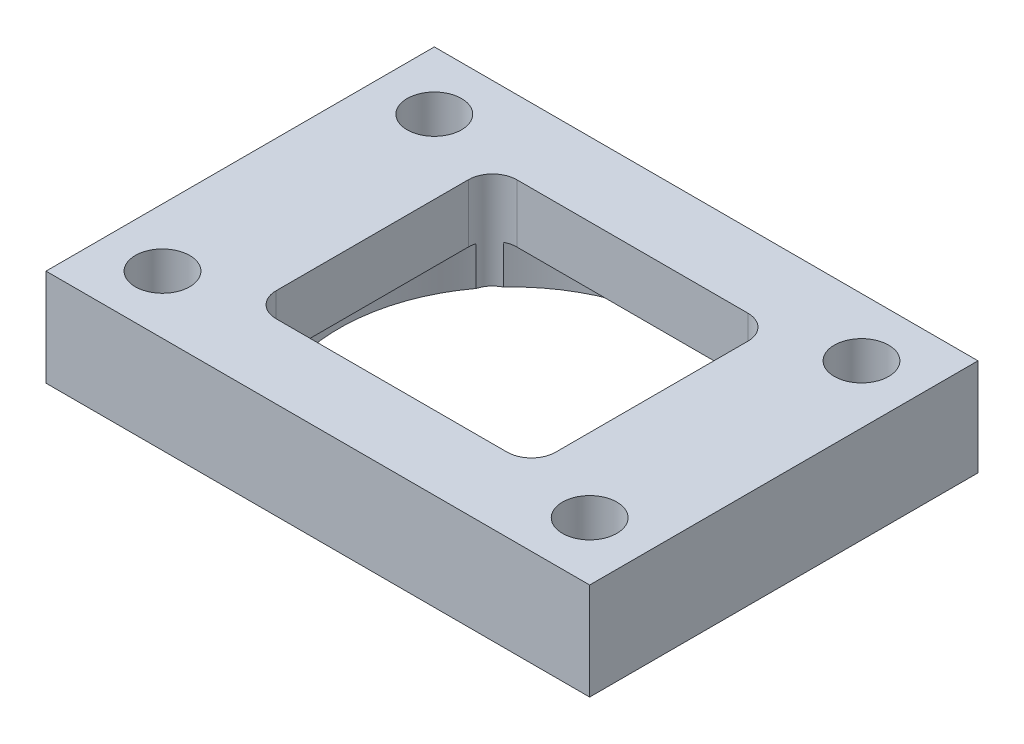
ISO-10303-21;
HEADER;
FILE_DESCRIPTION(('STEP AP214'),'2;1');
FILE_NAME('part.step','',(''),(''),'','','');
FILE_SCHEMA(('AUTOMOTIVE_DESIGN { 1 0 10303 214 1 1 1 1 }'));
ENDSEC;
DATA;
#1=APPLICATION_CONTEXT('core data for automotive mechanical design processes');
#2=APPLICATION_PROTOCOL_DEFINITION('international standard','automotive_design',2000,#1);
#3=PRODUCT_CONTEXT('',#1,'mechanical');
#4=PRODUCT('Part','Part','',(#3));
#5=PRODUCT_RELATED_PRODUCT_CATEGORY('part','',(#4));
#6=PRODUCT_DEFINITION_FORMATION('','',#4);
#7=PRODUCT_DEFINITION_CONTEXT('part definition',#1,'design');
#8=PRODUCT_DEFINITION('design','',#6,#7);
#9=PRODUCT_DEFINITION_SHAPE('','',#8);
#10=(LENGTH_UNIT() NAMED_UNIT(*) SI_UNIT(.MILLI.,.METRE.));
#11=(NAMED_UNIT(*) PLANE_ANGLE_UNIT() SI_UNIT($,.RADIAN.));
#12=(NAMED_UNIT(*) SI_UNIT($,.STERADIAN.) SOLID_ANGLE_UNIT());
#13=UNCERTAINTY_MEASURE_WITH_UNIT(LENGTH_MEASURE(1.E-05),#10,'distance_accuracy_value','');
#14=(GEOMETRIC_REPRESENTATION_CONTEXT(3) GLOBAL_UNCERTAINTY_ASSIGNED_CONTEXT((#13)) GLOBAL_UNIT_ASSIGNED_CONTEXT((#10,
#11,#12)) REPRESENTATION_CONTEXT('',''));
#15=CARTESIAN_POINT('',(0.,0.,0.));
#16=DIRECTION('',(0.,0.,1.));
#17=DIRECTION('',(1.,0.,0.));
#18=AXIS2_PLACEMENT_3D('',#15,#16,#17);
#19=CARTESIAN_POINT('',(0.,2.54,0.));
#20=DIRECTION('',(0.,-1.,0.));
#21=DIRECTION('',(0.,0.,-1.));
#22=AXIS2_PLACEMENT_3D('',#19,#20,#21);
#23=CYLINDRICAL_SURFACE('',#22,11.303);
#24=CARTESIAN_POINT('',(0.,0.,0.));
#25=DIRECTION('',(0.,-1.,0.));
#26=DIRECTION('',(0.,0.,-1.));
#27=AXIS2_PLACEMENT_3D('',#24,#25,#26);
#28=CIRCLE('',#27,11.303);
#29=CARTESIAN_POINT('',(-8.27041971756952,0.,-7.70441215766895));
#30=VERTEX_POINT('',#29);
#31=CARTESIAN_POINT('',(8.27041971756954,0.,-7.70441215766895));
#32=VERTEX_POINT('',#31);
#33=EDGE_CURVE('E310',#30,#32,#28,.T.);
#34=ORIENTED_EDGE('',*,*,#33,.T.);
#35=DIRECTION('',(0.,-1.,0.));
#36=VECTOR('',#35,1.);
#37=CARTESIAN_POINT('',(8.27041971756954,0.,-7.70441215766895));
#38=LINE('',#37,#36);
#39=CARTESIAN_POINT('',(8.27041971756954,2.54,-7.70441215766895));
#40=VERTEX_POINT('',#39);
#41=EDGE_CURVE('E239',#32,#40,#38,.F.);
#42=ORIENTED_EDGE('',*,*,#41,.T.);
#43=CARTESIAN_POINT('',(0.,2.54,0.));
#44=DIRECTION('',(0.,-1.,0.));
#45=DIRECTION('',(0.,0.,-1.));
#46=AXIS2_PLACEMENT_3D('',#43,#44,#45);
#47=CIRCLE('',#46,11.303);
#48=CARTESIAN_POINT('',(-8.27041971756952,2.54,-7.70441215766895));
#49=VERTEX_POINT('',#48);
#50=EDGE_CURVE('E316',#49,#40,#47,.T.);
#51=ORIENTED_EDGE('',*,*,#50,.F.);
#52=DIRECTION('',(0.,-1.,0.));
#53=VECTOR('',#52,1.);
#54=CARTESIAN_POINT('',(-8.27041971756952,2.54,-7.70441215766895));
#55=LINE('',#54,#53);
#56=EDGE_CURVE('E279',#49,#30,#55,.T.);
#57=ORIENTED_EDGE('',*,*,#56,.T.);
#58=EDGE_LOOP('',(#34,#42,#51,#57));
#59=FACE_BOUND('',#58,.T.);
#60=ADVANCED_FACE('F30',(#59),#23,.F.);
#61=CARTESIAN_POINT('',(9.08064390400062,0.,-6.73050631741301));
#62=VERTEX_POINT('',#61);
#63=CARTESIAN_POINT('',(9.08064390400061,0.,6.73050631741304));
#64=VERTEX_POINT('',#63);
#65=EDGE_CURVE('E312',#62,#64,#28,.T.);
#66=ORIENTED_EDGE('',*,*,#65,.T.);
#67=DIRECTION('',(0.,-1.,0.));
#68=VECTOR('',#67,1.);
#69=CARTESIAN_POINT('',(9.08064390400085,0.,6.7305063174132));
#70=LINE('',#69,#68);
#71=CARTESIAN_POINT('',(9.08064390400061,2.54,6.73050631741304));
#72=VERTEX_POINT('',#71);
#73=EDGE_CURVE('E255',#64,#72,#70,.F.);
#74=ORIENTED_EDGE('',*,*,#73,.T.);
#75=CARTESIAN_POINT('',(9.08064390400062,2.54,-6.73050631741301));
#76=VERTEX_POINT('',#75);
#77=EDGE_CURVE('E325',#76,#72,#47,.T.);
#78=ORIENTED_EDGE('',*,*,#77,.F.);
#79=DIRECTION('',(0.,-1.,0.));
#80=VECTOR('',#79,1.);
#81=CARTESIAN_POINT('',(9.08064390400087,2.54,-6.7305063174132));
#82=LINE('',#81,#80);
#83=EDGE_CURVE('E233',#76,#62,#82,.T.);
#84=ORIENTED_EDGE('',*,*,#83,.T.);
#85=EDGE_LOOP('',(#66,#74,#78,#84));
#86=FACE_BOUND('',#85,.T.);
#87=ADVANCED_FACE('F370',(#86),#23,.F.);
#88=CARTESIAN_POINT('',(8.27041971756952,0.,7.70441215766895));
#89=VERTEX_POINT('',#88);
#90=CARTESIAN_POINT('',(-8.27041971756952,0.,7.70441215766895));
#91=VERTEX_POINT('',#90);
#92=EDGE_CURVE('E309',#89,#91,#28,.T.);
#93=ORIENTED_EDGE('',*,*,#92,.T.);
#94=DIRECTION('',(0.,-1.,0.));
#95=VECTOR('',#94,1.);
#96=CARTESIAN_POINT('',(-8.27041971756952,0.,7.70441215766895));
#97=LINE('',#96,#95);
#98=CARTESIAN_POINT('',(-8.27041971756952,2.54,7.70441215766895));
#99=VERTEX_POINT('',#98);
#100=EDGE_CURVE('E269',#91,#99,#97,.F.);
#101=ORIENTED_EDGE('',*,*,#100,.T.);
#102=CARTESIAN_POINT('',(8.27041971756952,2.54,7.70441215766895));
#103=VERTEX_POINT('',#102);
#104=EDGE_CURVE('E400',#103,#99,#47,.T.);
#105=ORIENTED_EDGE('',*,*,#104,.F.);
#106=DIRECTION('',(0.,-1.,0.));
#107=VECTOR('',#106,1.);
#108=CARTESIAN_POINT('',(8.27041971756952,2.54,7.70441215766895));
#109=LINE('',#108,#107);
#110=EDGE_CURVE('E249',#103,#89,#109,.T.);
#111=ORIENTED_EDGE('',*,*,#110,.T.);
#112=EDGE_LOOP('',(#93,#101,#105,#111));
#113=FACE_BOUND('',#112,.T.);
#114=ADVANCED_FACE('F376',(#113),#23,.F.);
#115=CARTESIAN_POINT('',(0.,2.54,0.));
#116=DIRECTION('',(0.,-1.,0.));
#117=DIRECTION('',(0.,0.,-1.));
#118=AXIS2_PLACEMENT_3D('',#115,#116,#117);
#119=PLANE('',#118);
#120=DIRECTION('',(1.,0.,0.));
#121=VECTOR('',#120,1.);
#122=CARTESIAN_POINT('',(0.,2.54,-7.87399999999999));
#123=LINE('',#122,#121);
#124=CARTESIAN_POINT('',(-7.5565,2.54,-7.87399999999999));
#125=VERTEX_POINT('',#124);
#126=CARTESIAN_POINT('',(7.55650000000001,2.54,-7.87399999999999));
#127=VERTEX_POINT('',#126);
#128=EDGE_CURVE('E205',#125,#127,#123,.T.);
#129=ORIENTED_EDGE('',*,*,#128,.F.);
#130=CARTESIAN_POINT('',(-7.5565,2.54,-6.2865));
#131=DIRECTION('',(0.,-1.,0.));
#132=DIRECTION('',(0.,0.,-1.));
#133=AXIS2_PLACEMENT_3D('',#130,#131,#132);
#134=CIRCLE('',#133,1.5875);
#135=EDGE_CURVE('E276',#125,#49,#134,.F.);
#136=ORIENTED_EDGE('',*,*,#135,.T.);
#137=ORIENTED_EDGE('',*,*,#50,.T.);
#138=CARTESIAN_POINT('',(7.5565,2.54,-6.2865));
#139=DIRECTION('',(0.,-1.,0.));
#140=DIRECTION('',(0.,0.,-1.));
#141=AXIS2_PLACEMENT_3D('',#138,#139,#140);
#142=CIRCLE('',#141,1.5875);
#143=EDGE_CURVE('E242',#40,#127,#142,.F.);
#144=ORIENTED_EDGE('',*,*,#143,.T.);
#145=EDGE_LOOP('',(#129,#136,#137,#144));
#146=FACE_BOUND('',#145,.T.);
#147=ADVANCED_FACE('F387',(#146),#119,.T.);
#148=DIRECTION('',(0.,0.,1.));
#149=VECTOR('',#148,1.);
#150=CARTESIAN_POINT('',(9.144,2.54,0.));
#151=LINE('',#150,#149);
#152=CARTESIAN_POINT('',(9.14400000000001,2.54,-6.2865));
#153=VERTEX_POINT('',#152);
#154=CARTESIAN_POINT('',(9.144,2.54,6.2865));
#155=VERTEX_POINT('',#154);
#156=EDGE_CURVE('E202',#153,#155,#151,.T.);
#157=ORIENTED_EDGE('',*,*,#156,.F.);
#158=CARTESIAN_POINT('',(7.5565,2.54,-6.2865));
#159=DIRECTION('',(0.,-1.,0.));
#160=DIRECTION('',(0.,0.,-1.));
#161=AXIS2_PLACEMENT_3D('',#158,#159,#160);
#162=CIRCLE('',#161,1.5875);
#163=EDGE_CURVE('E230',#153,#76,#162,.F.);
#164=ORIENTED_EDGE('',*,*,#163,.T.);
#165=ORIENTED_EDGE('',*,*,#77,.T.);
#166=CARTESIAN_POINT('',(7.55650000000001,2.54,6.2865));
#167=DIRECTION('',(0.,-1.,0.));
#168=DIRECTION('',(0.,0.,-1.));
#169=AXIS2_PLACEMENT_3D('',#166,#167,#168);
#170=CIRCLE('',#169,1.5875);
#171=EDGE_CURVE('E258',#72,#155,#170,.F.);
#172=ORIENTED_EDGE('',*,*,#171,.T.);
#173=EDGE_LOOP('',(#157,#164,#165,#172));
#174=FACE_BOUND('',#173,.T.);
#175=ADVANCED_FACE('F396',(#174),#119,.T.);
#176=DIRECTION('',(-1.,0.,0.));
#177=VECTOR('',#176,1.);
#178=CARTESIAN_POINT('',(0.,2.54,7.87399999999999));
#179=LINE('',#178,#177);
#180=CARTESIAN_POINT('',(7.5565,2.54,7.87399999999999));
#181=VERTEX_POINT('',#180);
#182=CARTESIAN_POINT('',(-7.5565,2.54,7.87399999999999));
#183=VERTEX_POINT('',#182);
#184=EDGE_CURVE('E194',#181,#183,#179,.T.);
#185=ORIENTED_EDGE('',*,*,#184,.F.);
#186=CARTESIAN_POINT('',(7.55650000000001,2.54,6.2865));
#187=DIRECTION('',(0.,-1.,0.));
#188=DIRECTION('',(0.,0.,-1.));
#189=AXIS2_PLACEMENT_3D('',#186,#187,#188);
#190=CIRCLE('',#189,1.5875);
#191=EDGE_CURVE('E246',#181,#103,#190,.F.);
#192=ORIENTED_EDGE('',*,*,#191,.T.);
#193=ORIENTED_EDGE('',*,*,#104,.T.);
#194=CARTESIAN_POINT('',(-7.5565,2.54,6.2865));
#195=DIRECTION('',(0.,-1.,0.));
#196=DIRECTION('',(0.,0.,-1.));
#197=AXIS2_PLACEMENT_3D('',#194,#195,#196);
#198=CIRCLE('',#197,1.5875);
#199=EDGE_CURVE('E272',#99,#183,#198,.F.);
#200=ORIENTED_EDGE('',*,*,#199,.T.);
#201=EDGE_LOOP('',(#185,#192,#193,#200));
#202=FACE_BOUND('',#201,.T.);
#203=ADVANCED_FACE('F388',(#202),#119,.T.);
#204=CARTESIAN_POINT('',(17.78,6.34999999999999,-12.7));
#205=DIRECTION('',(0.,0.,1.));
#206=DIRECTION('',(1.,0.,0.));
#207=AXIS2_PLACEMENT_3D('',#204,#205,#206);
#208=PLANE('',#207);
#209=DIRECTION('',(-1.,0.,0.));
#210=VECTOR('',#209,1.);
#211=CARTESIAN_POINT('',(17.78,0.,-12.7));
#212=LINE('',#211,#210);
#213=CARTESIAN_POINT('',(17.78,0.,-12.7));
#214=VERTEX_POINT('',#213);
#215=CARTESIAN_POINT('',(-17.78,0.,-12.7));
#216=VERTEX_POINT('',#215);
#217=EDGE_CURVE('E190',#214,#216,#212,.T.);
#218=ORIENTED_EDGE('',*,*,#217,.T.);
#219=DIRECTION('',(0.,-1.,0.));
#220=VECTOR('',#219,1.);
#221=CARTESIAN_POINT('',(-17.78,6.34999999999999,-12.7));
#222=LINE('',#221,#220);
#223=CARTESIAN_POINT('',(-17.78,6.34999999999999,-12.7));
#224=VERTEX_POINT('',#223);
#225=EDGE_CURVE('E170',#224,#216,#222,.T.);
#226=ORIENTED_EDGE('',*,*,#225,.F.);
#227=DIRECTION('',(-1.,0.,0.));
#228=VECTOR('',#227,1.);
#229=CARTESIAN_POINT('',(17.78,6.34999999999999,-12.7));
#230=LINE('',#229,#228);
#231=CARTESIAN_POINT('',(17.78,6.34999999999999,-12.7));
#232=VERTEX_POINT('',#231);
#233=EDGE_CURVE('E177',#232,#224,#230,.T.);
#234=ORIENTED_EDGE('',*,*,#233,.F.);
#235=DIRECTION('',(0.,-1.,0.));
#236=VECTOR('',#235,1.);
#237=CARTESIAN_POINT('',(17.78,6.34999999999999,-12.7));
#238=LINE('',#237,#236);
#239=EDGE_CURVE('E345',#232,#214,#238,.T.);
#240=ORIENTED_EDGE('',*,*,#239,.T.);
#241=EDGE_LOOP('',(#218,#226,#234,#240));
#242=FACE_BOUND('',#241,.T.);
#243=ADVANCED_FACE('F188',(#242),#208,.F.);
#244=CARTESIAN_POINT('',(-17.78,6.34999999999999,12.7));
#245=DIRECTION('',(1.,0.,0.));
#246=DIRECTION('',(0.,0.,-1.));
#247=AXIS2_PLACEMENT_3D('',#244,#245,#246);
#248=PLANE('',#247);
#249=DIRECTION('',(0.,0.,1.));
#250=VECTOR('',#249,1.);
#251=CARTESIAN_POINT('',(-17.78,0.,12.7));
#252=LINE('',#251,#250);
#253=CARTESIAN_POINT('',(-17.78,0.,12.7));
#254=VERTEX_POINT('',#253);
#255=EDGE_CURVE('E347',#216,#254,#252,.T.);
#256=ORIENTED_EDGE('',*,*,#255,.T.);
#257=DIRECTION('',(0.,-1.,0.));
#258=VECTOR('',#257,1.);
#259=CARTESIAN_POINT('',(-17.78,6.34999999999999,12.7));
#260=LINE('',#259,#258);
#261=CARTESIAN_POINT('',(-17.78,6.34999999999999,12.7));
#262=VERTEX_POINT('',#261);
#263=EDGE_CURVE('E173',#262,#254,#260,.T.);
#264=ORIENTED_EDGE('',*,*,#263,.F.);
#265=DIRECTION('',(0.,0.,1.));
#266=VECTOR('',#265,1.);
#267=CARTESIAN_POINT('',(-17.78,6.34999999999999,12.7));
#268=LINE('',#267,#266);
#269=EDGE_CURVE('E166',#224,#262,#268,.T.);
#270=ORIENTED_EDGE('',*,*,#269,.F.);
#271=ORIENTED_EDGE('',*,*,#225,.T.);
#272=EDGE_LOOP('',(#256,#264,#270,#271));
#273=FACE_BOUND('',#272,.T.);
#274=ADVANCED_FACE('F168',(#273),#248,.F.);
#275=CARTESIAN_POINT('',(17.78,6.34999999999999,12.7));
#276=DIRECTION('',(0.,0.,-1.));
#277=DIRECTION('',(-1.,0.,0.));
#278=AXIS2_PLACEMENT_3D('',#275,#276,#277);
#279=PLANE('',#278);
#280=DIRECTION('',(1.,0.,0.));
#281=VECTOR('',#280,1.);
#282=CARTESIAN_POINT('',(17.78,0.,12.7));
#283=LINE('',#282,#281);
#284=CARTESIAN_POINT('',(17.78,0.,12.7));
#285=VERTEX_POINT('',#284);
#286=EDGE_CURVE('E349',#254,#285,#283,.T.);
#287=ORIENTED_EDGE('',*,*,#286,.T.);
#288=DIRECTION('',(0.,-1.,0.));
#289=VECTOR('',#288,1.);
#290=CARTESIAN_POINT('',(17.78,6.34999999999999,12.7));
#291=LINE('',#290,#289);
#292=CARTESIAN_POINT('',(17.78,6.34999999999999,12.7));
#293=VERTEX_POINT('',#292);
#294=EDGE_CURVE('E196',#293,#285,#291,.T.);
#295=ORIENTED_EDGE('',*,*,#294,.F.);
#296=DIRECTION('',(1.,0.,0.));
#297=VECTOR('',#296,1.);
#298=CARTESIAN_POINT('',(17.78,6.34999999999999,12.7));
#299=LINE('',#298,#297);
#300=EDGE_CURVE('E176',#262,#293,#299,.T.);
#301=ORIENTED_EDGE('',*,*,#300,.F.);
#302=ORIENTED_EDGE('',*,*,#263,.T.);
#303=EDGE_LOOP('',(#287,#295,#301,#302));
#304=FACE_BOUND('',#303,.T.);
#305=ADVANCED_FACE('F360',(#304),#279,.F.);
#306=CARTESIAN_POINT('',(17.78,6.34999999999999,12.7));
#307=DIRECTION('',(-1.,0.,0.));
#308=DIRECTION('',(0.,0.,1.));
#309=AXIS2_PLACEMENT_3D('',#306,#307,#308);
#310=PLANE('',#309);
#311=DIRECTION('',(0.,0.,-1.));
#312=VECTOR('',#311,1.);
#313=CARTESIAN_POINT('',(17.78,0.,12.7));
#314=LINE('',#313,#312);
#315=EDGE_CURVE('E186',#285,#214,#314,.T.);
#316=ORIENTED_EDGE('',*,*,#315,.T.);
#317=ORIENTED_EDGE('',*,*,#239,.F.);
#318=DIRECTION('',(0.,0.,-1.));
#319=VECTOR('',#318,1.);
#320=CARTESIAN_POINT('',(17.78,6.34999999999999,12.7));
#321=LINE('',#320,#319);
#322=EDGE_CURVE('E182',#293,#232,#321,.T.);
#323=ORIENTED_EDGE('',*,*,#322,.F.);
#324=ORIENTED_EDGE('',*,*,#294,.T.);
#325=EDGE_LOOP('',(#316,#317,#323,#324));
#326=FACE_BOUND('',#325,.T.);
#327=ADVANCED_FACE('F356',(#326),#310,.F.);
#328=CARTESIAN_POINT('',(-17.78,6.34999999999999,-12.7));
#329=DIRECTION('',(0.,-1.,0.));
#330=DIRECTION('',(0.,0.,-1.));
#331=AXIS2_PLACEMENT_3D('',#328,#329,#330);
#332=PLANE('',#331);
#333=DIRECTION('',(0.,0.,1.));
#334=VECTOR('',#333,1.);
#335=CARTESIAN_POINT('',(-9.144,6.34999999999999,7.87399999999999));
#336=LINE('',#335,#334);
#337=CARTESIAN_POINT('',(-9.144,6.34999999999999,-6.2865));
#338=VERTEX_POINT('',#337);
#339=CARTESIAN_POINT('',(-9.144,6.34999999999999,6.2865));
#340=VERTEX_POINT('',#339);
#341=EDGE_CURVE('E298',#338,#340,#336,.T.);
#342=ORIENTED_EDGE('',*,*,#341,.F.);
#343=CARTESIAN_POINT('',(-7.5565,6.34999999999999,-6.2865));
#344=DIRECTION('',(0.,-1.,0.));
#345=DIRECTION('',(0.,0.,-1.));
#346=AXIS2_PLACEMENT_3D('',#343,#344,#345);
#347=CIRCLE('',#346,1.5875);
#348=CARTESIAN_POINT('',(-7.5565,6.34999999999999,-7.87399999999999));
#349=VERTEX_POINT('',#348);
#350=EDGE_CURVE('E274',#338,#349,#347,.T.);
#351=ORIENTED_EDGE('',*,*,#350,.T.);
#352=DIRECTION('',(-1.,0.,0.));
#353=VECTOR('',#352,1.);
#354=CARTESIAN_POINT('',(9.144,6.34999999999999,-7.87399999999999));
#355=LINE('',#354,#353);
#356=CARTESIAN_POINT('',(7.55650000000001,6.34999999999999,-7.87399999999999));
#357=VERTEX_POINT('',#356);
#358=EDGE_CURVE('E425',#357,#349,#355,.T.);
#359=ORIENTED_EDGE('',*,*,#358,.F.);
#360=CARTESIAN_POINT('',(7.5565,6.34999999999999,-6.2865));
#361=DIRECTION('',(0.,-1.,0.));
#362=DIRECTION('',(0.,0.,-1.));
#363=AXIS2_PLACEMENT_3D('',#360,#361,#362);
#364=CIRCLE('',#363,1.5875);
#365=CARTESIAN_POINT('',(9.14400000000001,6.34999999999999,-6.2865));
#366=VERTEX_POINT('',#365);
#367=EDGE_CURVE('E228',#357,#366,#364,.T.);
#368=ORIENTED_EDGE('',*,*,#367,.T.);
#369=DIRECTION('',(0.,0.,-1.));
#370=VECTOR('',#369,1.);
#371=CARTESIAN_POINT('',(9.144,6.34999999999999,7.87399999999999));
#372=LINE('',#371,#370);
#373=CARTESIAN_POINT('',(9.144,6.34999999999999,6.2865));
#374=VERTEX_POINT('',#373);
#375=EDGE_CURVE('E313',#374,#366,#372,.T.);
#376=ORIENTED_EDGE('',*,*,#375,.F.);
#377=CARTESIAN_POINT('',(7.55650000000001,6.34999999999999,6.2865));
#378=DIRECTION('',(0.,-1.,0.));
#379=DIRECTION('',(0.,0.,-1.));
#380=AXIS2_PLACEMENT_3D('',#377,#378,#379);
#381=CIRCLE('',#380,1.5875);
#382=CARTESIAN_POINT('',(7.5565,6.34999999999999,7.87399999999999));
#383=VERTEX_POINT('',#382);
#384=EDGE_CURVE('E244',#374,#383,#381,.T.);
#385=ORIENTED_EDGE('',*,*,#384,.T.);
#386=DIRECTION('',(1.,0.,0.));
#387=VECTOR('',#386,1.);
#388=CARTESIAN_POINT('',(9.144,6.34999999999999,7.87399999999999));
#389=LINE('',#388,#387);
#390=CARTESIAN_POINT('',(-7.5565,6.34999999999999,7.87399999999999));
#391=VERTEX_POINT('',#390);
#392=EDGE_CURVE('E430',#391,#383,#389,.T.);
#393=ORIENTED_EDGE('',*,*,#392,.F.);
#394=CARTESIAN_POINT('',(-7.5565,6.34999999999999,6.2865));
#395=DIRECTION('',(0.,-1.,0.));
#396=DIRECTION('',(0.,0.,-1.));
#397=AXIS2_PLACEMENT_3D('',#394,#395,#396);
#398=CIRCLE('',#397,1.5875);
#399=EDGE_CURVE('E260',#391,#340,#398,.T.);
#400=ORIENTED_EDGE('',*,*,#399,.T.);
#401=EDGE_LOOP('',(#342,#351,#359,#368,#376,#385,#393,#400));
#402=FACE_BOUND('',#401,.T.);
#403=CARTESIAN_POINT('',(-13.97,6.34999999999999,-8.88999999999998));
#404=DIRECTION('',(0.,1.,0.));
#405=DIRECTION('',(0.,0.,-1.));
#406=AXIS2_PLACEMENT_3D('',#403,#404,#405);
#407=CIRCLE('',#406,1.778);
#408=CARTESIAN_POINT('',(-13.97,6.34999999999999,-10.668));
#409=VERTEX_POINT('',#408);
#410=EDGE_CURVE('E322',#409,#409,#407,.T.);
#411=ORIENTED_EDGE('',*,*,#410,.F.);
#412=EDGE_LOOP('',(#411));
#413=FACE_BOUND('',#412,.T.);
#414=CARTESIAN_POINT('',(-13.97,6.34999999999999,8.89000000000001));
#415=DIRECTION('',(0.,1.,0.));
#416=DIRECTION('',(0.,0.,1.));
#417=AXIS2_PLACEMENT_3D('',#414,#415,#416);
#418=CIRCLE('',#417,1.778);
#419=CARTESIAN_POINT('',(-13.97,6.34999999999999,10.668));
#420=VERTEX_POINT('',#419);
#421=EDGE_CURVE('E321',#420,#420,#418,.T.);
#422=ORIENTED_EDGE('',*,*,#421,.F.);
#423=EDGE_LOOP('',(#422));
#424=FACE_BOUND('',#423,.T.);
#425=CARTESIAN_POINT('',(13.97,6.34999999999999,8.88999999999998));
#426=DIRECTION('',(0.,1.,0.));
#427=DIRECTION('',(0.,0.,-1.));
#428=AXIS2_PLACEMENT_3D('',#425,#426,#427);
#429=CIRCLE('',#428,1.77800000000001);
#430=CARTESIAN_POINT('',(13.97,6.34999999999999,7.11199999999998));
#431=VERTEX_POINT('',#430);
#432=EDGE_CURVE('E329',#431,#431,#429,.T.);
#433=ORIENTED_EDGE('',*,*,#432,.F.);
#434=EDGE_LOOP('',(#433));
#435=FACE_BOUND('',#434,.T.);
#436=CARTESIAN_POINT('',(13.97,6.34999999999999,-8.89000000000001));
#437=DIRECTION('',(0.,1.,0.));
#438=DIRECTION('',(0.,0.,1.));
#439=AXIS2_PLACEMENT_3D('',#436,#437,#438);
#440=CIRCLE('',#439,1.77800000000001);
#441=CARTESIAN_POINT('',(13.97,6.34999999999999,-7.112));
#442=VERTEX_POINT('',#441);
#443=EDGE_CURVE('E335',#442,#442,#440,.T.);
#444=ORIENTED_EDGE('',*,*,#443,.F.);
#445=EDGE_LOOP('',(#444));
#446=FACE_BOUND('',#445,.T.);
#447=ORIENTED_EDGE('',*,*,#233,.T.);
#448=ORIENTED_EDGE('',*,*,#269,.T.);
#449=ORIENTED_EDGE('',*,*,#300,.T.);
#450=ORIENTED_EDGE('',*,*,#322,.T.);
#451=EDGE_LOOP('',(#447,#448,#449,#450));
#452=FACE_BOUND('',#451,.T.);
#453=ADVANCED_FACE('F180',(#402,#413,#424,#435,#446,#452),#332,.F.);
#454=CARTESIAN_POINT('',(-17.78,0.,-12.7));
#455=DIRECTION('',(0.,-1.,0.));
#456=DIRECTION('',(0.,0.,-1.));
#457=AXIS2_PLACEMENT_3D('',#454,#455,#456);
#458=PLANE('',#457);
#459=ORIENTED_EDGE('',*,*,#65,.F.);
#460=CARTESIAN_POINT('',(7.5565,0.,-6.2865));
#461=DIRECTION('',(0.,-1.,0.));
#462=DIRECTION('',(0.,0.,-1.));
#463=AXIS2_PLACEMENT_3D('',#460,#461,#462);
#464=CIRCLE('',#463,1.5875);
#465=EDGE_CURVE('E236',#62,#32,#464,.F.);
#466=ORIENTED_EDGE('',*,*,#465,.T.);
#467=ORIENTED_EDGE('',*,*,#33,.F.);
#468=CARTESIAN_POINT('',(-7.5565,0.,-6.2865));
#469=DIRECTION('',(0.,-1.,0.));
#470=DIRECTION('',(0.,0.,-1.));
#471=AXIS2_PLACEMENT_3D('',#468,#469,#470);
#472=CIRCLE('',#471,1.5875);
#473=CARTESIAN_POINT('',(-9.08064390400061,0.,-6.73050631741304));
#474=VERTEX_POINT('',#473);
#475=EDGE_CURVE('E282',#30,#474,#472,.F.);
#476=ORIENTED_EDGE('',*,*,#475,.T.);
#477=CARTESIAN_POINT('',(-9.08064390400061,0.,6.73050631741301));
#478=VERTEX_POINT('',#477);
#479=EDGE_CURVE('E51',#478,#474,#28,.T.);
#480=ORIENTED_EDGE('',*,*,#479,.F.);
#481=CARTESIAN_POINT('',(-7.5565,0.,6.2865));
#482=DIRECTION('',(0.,-1.,0.));
#483=DIRECTION('',(0.,0.,-1.));
#484=AXIS2_PLACEMENT_3D('',#481,#482,#483);
#485=CIRCLE('',#484,1.5875);
#486=EDGE_CURVE('E266',#478,#91,#485,.F.);
#487=ORIENTED_EDGE('',*,*,#486,.T.);
#488=ORIENTED_EDGE('',*,*,#92,.F.);
#489=CARTESIAN_POINT('',(7.55650000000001,0.,6.2865));
#490=DIRECTION('',(0.,-1.,0.));
#491=DIRECTION('',(0.,0.,-1.));
#492=AXIS2_PLACEMENT_3D('',#489,#490,#491);
#493=CIRCLE('',#492,1.5875);
#494=EDGE_CURVE('E252',#89,#64,#493,.F.);
#495=ORIENTED_EDGE('',*,*,#494,.T.);
#496=EDGE_LOOP('',(#459,#466,#467,#476,#480,#487,#488,#495));
#497=FACE_BOUND('',#496,.T.);
#498=CARTESIAN_POINT('',(-13.97,0.,-8.88999999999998));
#499=DIRECTION('',(0.,1.,0.));
#500=DIRECTION('',(0.,0.,-1.));
#501=AXIS2_PLACEMENT_3D('',#498,#499,#500);
#502=CIRCLE('',#501,1.778);
#503=CARTESIAN_POINT('',(-13.97,0.,-10.668));
#504=VERTEX_POINT('',#503);
#505=EDGE_CURVE('E318',#504,#504,#502,.T.);
#506=ORIENTED_EDGE('',*,*,#505,.T.);
#507=EDGE_LOOP('',(#506));
#508=FACE_BOUND('',#507,.T.);
#509=CARTESIAN_POINT('',(-13.97,0.,8.89000000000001));
#510=DIRECTION('',(0.,1.,0.));
#511=DIRECTION('',(0.,0.,1.));
#512=AXIS2_PLACEMENT_3D('',#509,#510,#511);
#513=CIRCLE('',#512,1.778);
#514=CARTESIAN_POINT('',(-13.97,0.,10.668));
#515=VERTEX_POINT('',#514);
#516=EDGE_CURVE('E326',#515,#515,#513,.T.);
#517=ORIENTED_EDGE('',*,*,#516,.T.);
#518=EDGE_LOOP('',(#517));
#519=FACE_BOUND('',#518,.T.);
#520=CARTESIAN_POINT('',(13.97,0.,8.88999999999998));
#521=DIRECTION('',(0.,1.,0.));
#522=DIRECTION('',(0.,0.,-1.));
#523=AXIS2_PLACEMENT_3D('',#520,#521,#522);
#524=CIRCLE('',#523,1.77800000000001);
#525=CARTESIAN_POINT('',(13.97,0.,7.11199999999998));
#526=VERTEX_POINT('',#525);
#527=EDGE_CURVE('E332',#526,#526,#524,.T.);
#528=ORIENTED_EDGE('',*,*,#527,.T.);
#529=EDGE_LOOP('',(#528));
#530=FACE_BOUND('',#529,.T.);
#531=CARTESIAN_POINT('',(13.97,0.,-8.89000000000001));
#532=DIRECTION('',(0.,1.,0.));
#533=DIRECTION('',(0.,0.,1.));
#534=AXIS2_PLACEMENT_3D('',#531,#532,#533);
#535=CIRCLE('',#534,1.77800000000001);
#536=CARTESIAN_POINT('',(13.97,0.,-7.112));
#537=VERTEX_POINT('',#536);
#538=EDGE_CURVE('E338',#537,#537,#535,.T.);
#539=ORIENTED_EDGE('',*,*,#538,.T.);
#540=EDGE_LOOP('',(#539));
#541=FACE_BOUND('',#540,.T.);
#542=ORIENTED_EDGE('',*,*,#217,.F.);
#543=ORIENTED_EDGE('',*,*,#315,.F.);
#544=ORIENTED_EDGE('',*,*,#286,.F.);
#545=ORIENTED_EDGE('',*,*,#255,.F.);
#546=EDGE_LOOP('',(#542,#543,#544,#545));
#547=FACE_BOUND('',#546,.T.);
#548=ADVANCED_FACE('F307',(#497,#508,#519,#530,#541,#547),#458,.T.);
#549=CARTESIAN_POINT('',(13.97,0.,-8.89000000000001));
#550=DIRECTION('',(0.,1.,0.));
#551=DIRECTION('',(0.,0.,1.));
#552=AXIS2_PLACEMENT_3D('',#549,#550,#551);
#553=CYLINDRICAL_SURFACE('',#552,1.77800000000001);
#554=ORIENTED_EDGE('',*,*,#538,.F.);
#555=EDGE_LOOP('',(#554));
#556=FACE_BOUND('',#555,.T.);
#557=ORIENTED_EDGE('',*,*,#443,.T.);
#558=EDGE_LOOP('',(#557));
#559=FACE_BOUND('',#558,.T.);
#560=ADVANCED_FACE('F519',(#556,#559),#553,.F.);
#561=CARTESIAN_POINT('',(13.97,0.,8.88999999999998));
#562=DIRECTION('',(0.,1.,0.));
#563=DIRECTION('',(0.,0.,1.));
#564=AXIS2_PLACEMENT_3D('',#561,#562,#563);
#565=CYLINDRICAL_SURFACE('',#564,1.77800000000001);
#566=ORIENTED_EDGE('',*,*,#527,.F.);
#567=EDGE_LOOP('',(#566));
#568=FACE_BOUND('',#567,.T.);
#569=ORIENTED_EDGE('',*,*,#432,.T.);
#570=EDGE_LOOP('',(#569));
#571=FACE_BOUND('',#570,.T.);
#572=ADVANCED_FACE('F526',(#568,#571),#565,.F.);
#573=CARTESIAN_POINT('',(-13.97,0.,8.89000000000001));
#574=DIRECTION('',(0.,1.,0.));
#575=DIRECTION('',(0.,0.,1.));
#576=AXIS2_PLACEMENT_3D('',#573,#574,#575);
#577=CYLINDRICAL_SURFACE('',#576,1.778);
#578=ORIENTED_EDGE('',*,*,#516,.F.);
#579=EDGE_LOOP('',(#578));
#580=FACE_BOUND('',#579,.T.);
#581=ORIENTED_EDGE('',*,*,#421,.T.);
#582=EDGE_LOOP('',(#581));
#583=FACE_BOUND('',#582,.T.);
#584=ADVANCED_FACE('F389',(#580,#583),#577,.F.);
#585=CARTESIAN_POINT('',(-13.97,0.,-8.88999999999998));
#586=DIRECTION('',(0.,1.,0.));
#587=DIRECTION('',(0.,0.,1.));
#588=AXIS2_PLACEMENT_3D('',#585,#586,#587);
#589=CYLINDRICAL_SURFACE('',#588,1.778);
#590=ORIENTED_EDGE('',*,*,#505,.F.);
#591=EDGE_LOOP('',(#590));
#592=FACE_BOUND('',#591,.T.);
#593=ORIENTED_EDGE('',*,*,#410,.T.);
#594=EDGE_LOOP('',(#593));
#595=FACE_BOUND('',#594,.T.);
#596=ADVANCED_FACE('F381',(#592,#595),#589,.F.);
#597=ORIENTED_EDGE('',*,*,#479,.T.);
#598=DIRECTION('',(0.,-1.,0.));
#599=VECTOR('',#598,1.);
#600=CARTESIAN_POINT('',(-9.08064390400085,0.,-6.7305063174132));
#601=LINE('',#600,#599);
#602=CARTESIAN_POINT('',(-9.08064390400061,2.54,-6.73050631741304));
#603=VERTEX_POINT('',#602);
#604=EDGE_CURVE('E38',#474,#603,#601,.F.);
#605=ORIENTED_EDGE('',*,*,#604,.T.);
#606=CARTESIAN_POINT('',(-9.08064390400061,2.54,6.73050631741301));
#607=VERTEX_POINT('',#606);
#608=EDGE_CURVE('E44',#607,#603,#47,.T.);
#609=ORIENTED_EDGE('',*,*,#608,.F.);
#610=DIRECTION('',(0.,-1.,0.));
#611=VECTOR('',#610,1.);
#612=CARTESIAN_POINT('',(-9.08064390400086,2.54,6.7305063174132));
#613=LINE('',#612,#611);
#614=EDGE_CURVE('E264',#607,#478,#613,.T.);
#615=ORIENTED_EDGE('',*,*,#614,.T.);
#616=EDGE_LOOP('',(#597,#605,#609,#615));
#617=FACE_BOUND('',#616,.T.);
#618=ADVANCED_FACE('F285',(#617),#23,.F.);
#619=DIRECTION('',(0.,0.,-1.));
#620=VECTOR('',#619,1.);
#621=CARTESIAN_POINT('',(-9.144,2.54,0.));
#622=LINE('',#621,#620);
#623=CARTESIAN_POINT('',(-9.144,2.54,6.2865));
#624=VERTEX_POINT('',#623);
#625=CARTESIAN_POINT('',(-9.144,2.54,-6.2865));
#626=VERTEX_POINT('',#625);
#627=EDGE_CURVE('E191',#624,#626,#622,.T.);
#628=ORIENTED_EDGE('',*,*,#627,.F.);
#629=CARTESIAN_POINT('',(-7.5565,2.54,6.2865));
#630=DIRECTION('',(0.,-1.,0.));
#631=DIRECTION('',(0.,0.,-1.));
#632=AXIS2_PLACEMENT_3D('',#629,#630,#631);
#633=CIRCLE('',#632,1.5875);
#634=EDGE_CURVE('E262',#624,#607,#633,.F.);
#635=ORIENTED_EDGE('',*,*,#634,.T.);
#636=ORIENTED_EDGE('',*,*,#608,.T.);
#637=CARTESIAN_POINT('',(-7.5565,2.54,-6.2865));
#638=DIRECTION('',(0.,-1.,0.));
#639=DIRECTION('',(0.,0.,-1.));
#640=AXIS2_PLACEMENT_3D('',#637,#638,#639);
#641=CIRCLE('',#640,1.5875);
#642=EDGE_CURVE('E11',#603,#626,#641,.F.);
#643=ORIENTED_EDGE('',*,*,#642,.T.);
#644=EDGE_LOOP('',(#628,#635,#636,#643));
#645=FACE_BOUND('',#644,.T.);
#646=ADVANCED_FACE('F291',(#645),#119,.T.);
#647=CARTESIAN_POINT('',(9.144,0.,-7.87399999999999));
#648=DIRECTION('',(0.,0.,-1.));
#649=DIRECTION('',(-1.,0.,0.));
#650=AXIS2_PLACEMENT_3D('',#647,#648,#649);
#651=PLANE('',#650);
#652=ORIENTED_EDGE('',*,*,#128,.T.);
#653=DIRECTION('',(0.,1.,0.));
#654=VECTOR('',#653,1.);
#655=CARTESIAN_POINT('',(7.55650000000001,6.34999999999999,-7.87399999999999));
#656=LINE('',#655,#654);
#657=EDGE_CURVE('E210',#127,#357,#656,.T.);
#658=ORIENTED_EDGE('',*,*,#657,.T.);
#659=ORIENTED_EDGE('',*,*,#358,.T.);
#660=DIRECTION('',(0.,1.,0.));
#661=VECTOR('',#660,1.);
#662=CARTESIAN_POINT('',(-7.5565,0.,-7.87399999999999));
#663=LINE('',#662,#661);
#664=EDGE_CURVE('E208',#349,#125,#663,.F.);
#665=ORIENTED_EDGE('',*,*,#664,.T.);
#666=EDGE_LOOP('',(#652,#658,#659,#665));
#667=FACE_BOUND('',#666,.T.);
#668=ADVANCED_FACE('F386',(#667),#651,.F.);
#669=CARTESIAN_POINT('',(9.144,0.,7.87399999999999));
#670=DIRECTION('',(1.,0.,0.));
#671=DIRECTION('',(0.,0.,-1.));
#672=AXIS2_PLACEMENT_3D('',#669,#670,#671);
#673=PLANE('',#672);
#674=ORIENTED_EDGE('',*,*,#375,.T.);
#675=DIRECTION('',(0.,1.,0.));
#676=VECTOR('',#675,1.);
#677=CARTESIAN_POINT('',(9.14400000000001,0.,-6.2865));
#678=LINE('',#677,#676);
#679=EDGE_CURVE('E216',#366,#153,#678,.F.);
#680=ORIENTED_EDGE('',*,*,#679,.T.);
#681=ORIENTED_EDGE('',*,*,#156,.T.);
#682=DIRECTION('',(0.,1.,0.));
#683=VECTOR('',#682,1.);
#684=CARTESIAN_POINT('',(9.144,6.34999999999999,6.2865));
#685=LINE('',#684,#683);
#686=EDGE_CURVE('E213',#155,#374,#685,.T.);
#687=ORIENTED_EDGE('',*,*,#686,.T.);
#688=EDGE_LOOP('',(#674,#680,#681,#687));
#689=FACE_BOUND('',#688,.T.);
#690=ADVANCED_FACE('F427',(#689),#673,.F.);
#691=CARTESIAN_POINT('',(9.144,0.,7.87399999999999));
#692=DIRECTION('',(0.,0.,1.));
#693=DIRECTION('',(1.,0.,0.));
#694=AXIS2_PLACEMENT_3D('',#691,#692,#693);
#695=PLANE('',#694);
#696=ORIENTED_EDGE('',*,*,#392,.T.);
#697=DIRECTION('',(0.,1.,0.));
#698=VECTOR('',#697,1.);
#699=CARTESIAN_POINT('',(7.5565,0.,7.87399999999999));
#700=LINE('',#699,#698);
#701=EDGE_CURVE('E221',#383,#181,#700,.F.);
#702=ORIENTED_EDGE('',*,*,#701,.T.);
#703=ORIENTED_EDGE('',*,*,#184,.T.);
#704=DIRECTION('',(0.,1.,0.));
#705=VECTOR('',#704,1.);
#706=CARTESIAN_POINT('',(-7.5565,6.34999999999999,7.87399999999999));
#707=LINE('',#706,#705);
#708=EDGE_CURVE('E218',#183,#391,#707,.T.);
#709=ORIENTED_EDGE('',*,*,#708,.T.);
#710=EDGE_LOOP('',(#696,#702,#703,#709));
#711=FACE_BOUND('',#710,.T.);
#712=ADVANCED_FACE('F438',(#711),#695,.F.);
#713=CARTESIAN_POINT('',(-9.144,0.,7.87399999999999));
#714=DIRECTION('',(-1.,0.,0.));
#715=DIRECTION('',(0.,0.,1.));
#716=AXIS2_PLACEMENT_3D('',#713,#714,#715);
#717=PLANE('',#716);
#718=ORIENTED_EDGE('',*,*,#341,.T.);
#719=DIRECTION('',(0.,1.,0.));
#720=VECTOR('',#719,1.);
#721=CARTESIAN_POINT('',(-9.144,0.,6.2865));
#722=LINE('',#721,#720);
#723=EDGE_CURVE('E226',#340,#624,#722,.F.);
#724=ORIENTED_EDGE('',*,*,#723,.T.);
#725=ORIENTED_EDGE('',*,*,#627,.T.);
#726=DIRECTION('',(0.,1.,0.));
#727=VECTOR('',#726,1.);
#728=CARTESIAN_POINT('',(-9.144,6.34999999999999,-6.2865));
#729=LINE('',#728,#727);
#730=EDGE_CURVE('E223',#626,#338,#729,.T.);
#731=ORIENTED_EDGE('',*,*,#730,.T.);
#732=EDGE_LOOP('',(#718,#724,#725,#731));
#733=FACE_BOUND('',#732,.T.);
#734=ADVANCED_FACE('F295',(#733),#717,.F.);
#735=CARTESIAN_POINT('',(7.5565,0.,-6.2865));
#736=DIRECTION('',(0.,-1.,0.));
#737=DIRECTION('',(0.,0.,-1.));
#738=AXIS2_PLACEMENT_3D('',#735,#736,#737);
#739=CYLINDRICAL_SURFACE('',#738,1.5875);
#740=ORIENTED_EDGE('',*,*,#163,.F.);
#741=ORIENTED_EDGE('',*,*,#679,.F.);
#742=ORIENTED_EDGE('',*,*,#367,.F.);
#743=ORIENTED_EDGE('',*,*,#657,.F.);
#744=ORIENTED_EDGE('',*,*,#143,.F.);
#745=ORIENTED_EDGE('',*,*,#41,.F.);
#746=ORIENTED_EDGE('',*,*,#465,.F.);
#747=ORIENTED_EDGE('',*,*,#83,.F.);
#748=EDGE_LOOP('',(#740,#741,#742,#743,#744,#745,#746,#747));
#749=FACE_BOUND('',#748,.T.);
#750=ADVANCED_FACE('F411',(#749),#739,.F.);
#751=CARTESIAN_POINT('',(7.55650000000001,0.,6.2865));
#752=DIRECTION('',(0.,-1.,0.));
#753=DIRECTION('',(0.,0.,-1.));
#754=AXIS2_PLACEMENT_3D('',#751,#752,#753);
#755=CYLINDRICAL_SURFACE('',#754,1.5875);
#756=ORIENTED_EDGE('',*,*,#191,.F.);
#757=ORIENTED_EDGE('',*,*,#701,.F.);
#758=ORIENTED_EDGE('',*,*,#384,.F.);
#759=ORIENTED_EDGE('',*,*,#686,.F.);
#760=ORIENTED_EDGE('',*,*,#171,.F.);
#761=ORIENTED_EDGE('',*,*,#73,.F.);
#762=ORIENTED_EDGE('',*,*,#494,.F.);
#763=ORIENTED_EDGE('',*,*,#110,.F.);
#764=EDGE_LOOP('',(#756,#757,#758,#759,#760,#761,#762,#763));
#765=FACE_BOUND('',#764,.T.);
#766=ADVANCED_FACE('F404',(#765),#755,.F.);
#767=CARTESIAN_POINT('',(-7.5565,0.,6.2865));
#768=DIRECTION('',(0.,-1.,0.));
#769=DIRECTION('',(0.,0.,-1.));
#770=AXIS2_PLACEMENT_3D('',#767,#768,#769);
#771=CYLINDRICAL_SURFACE('',#770,1.5875);
#772=ORIENTED_EDGE('',*,*,#634,.F.);
#773=ORIENTED_EDGE('',*,*,#723,.F.);
#774=ORIENTED_EDGE('',*,*,#399,.F.);
#775=ORIENTED_EDGE('',*,*,#708,.F.);
#776=ORIENTED_EDGE('',*,*,#199,.F.);
#777=ORIENTED_EDGE('',*,*,#100,.F.);
#778=ORIENTED_EDGE('',*,*,#486,.F.);
#779=ORIENTED_EDGE('',*,*,#614,.F.);
#780=EDGE_LOOP('',(#772,#773,#774,#775,#776,#777,#778,#779));
#781=FACE_BOUND('',#780,.T.);
#782=ADVANCED_FACE('F300',(#781),#771,.F.);
#783=CARTESIAN_POINT('',(-7.5565,0.,-6.2865));
#784=DIRECTION('',(0.,-1.,0.));
#785=DIRECTION('',(0.,0.,-1.));
#786=AXIS2_PLACEMENT_3D('',#783,#784,#785);
#787=CYLINDRICAL_SURFACE('',#786,1.5875);
#788=ORIENTED_EDGE('',*,*,#135,.F.);
#789=ORIENTED_EDGE('',*,*,#664,.F.);
#790=ORIENTED_EDGE('',*,*,#350,.F.);
#791=ORIENTED_EDGE('',*,*,#730,.F.);
#792=ORIENTED_EDGE('',*,*,#642,.F.);
#793=ORIENTED_EDGE('',*,*,#604,.F.);
#794=ORIENTED_EDGE('',*,*,#475,.F.);
#795=ORIENTED_EDGE('',*,*,#56,.F.);
#796=EDGE_LOOP('',(#788,#789,#790,#791,#792,#793,#794,#795));
#797=FACE_BOUND('',#796,.T.);
#798=ADVANCED_FACE('F32',(#797),#787,.F.);
#799=CLOSED_SHELL('',(#60,#87,#114,#147,#175,#203,#243,#274,#305,#327,#453,#548,#560,#572,#584,
#596,#618,#646,#668,#690,#712,#734,#750,#766,#782,#798));
#800=MANIFOLD_SOLID_BREP('B2',#799);
#801=ADVANCED_BREP_SHAPE_REPRESENTATION('',(#18,#800),#14);
#802=SHAPE_DEFINITION_REPRESENTATION(#9,#801);
ENDSEC;
END-ISO-10303-21;
